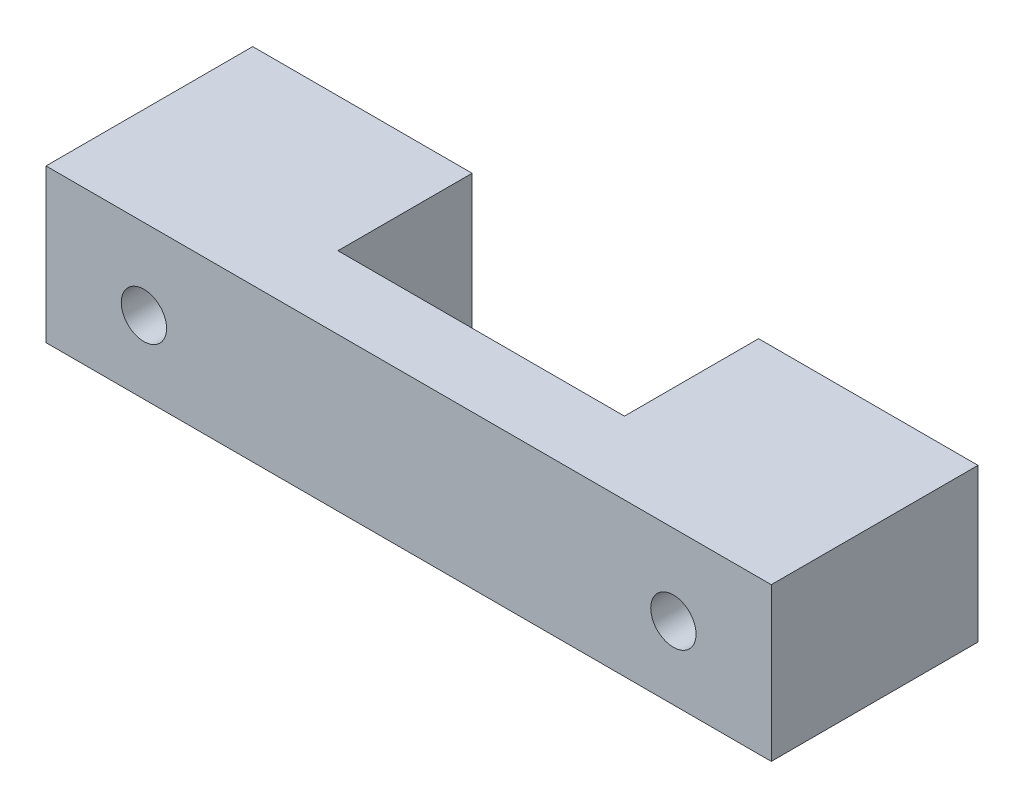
ISO-10303-21;
HEADER;
FILE_DESCRIPTION(('STEP AP214'),'2;1');
FILE_NAME('part.step','',(''),(''),'','','');
FILE_SCHEMA(('AUTOMOTIVE_DESIGN { 1 0 10303 214 1 1 1 1 }'));
ENDSEC;
DATA;
#1=APPLICATION_CONTEXT('core data for automotive mechanical design processes');
#2=APPLICATION_PROTOCOL_DEFINITION('international standard','automotive_design',2000,#1);
#3=PRODUCT_CONTEXT('',#1,'mechanical');
#4=PRODUCT('Part','Part','',(#3));
#5=PRODUCT_RELATED_PRODUCT_CATEGORY('part','',(#4));
#6=PRODUCT_DEFINITION_FORMATION('','',#4);
#7=PRODUCT_DEFINITION_CONTEXT('part definition',#1,'design');
#8=PRODUCT_DEFINITION('design','',#6,#7);
#9=PRODUCT_DEFINITION_SHAPE('','',#8);
#10=(LENGTH_UNIT() NAMED_UNIT(*) SI_UNIT(.MILLI.,.METRE.));
#11=(NAMED_UNIT(*) PLANE_ANGLE_UNIT() SI_UNIT($,.RADIAN.));
#12=(NAMED_UNIT(*) SI_UNIT($,.STERADIAN.) SOLID_ANGLE_UNIT());
#13=UNCERTAINTY_MEASURE_WITH_UNIT(LENGTH_MEASURE(1.E-05),#10,'distance_accuracy_value','');
#14=(GEOMETRIC_REPRESENTATION_CONTEXT(3) GLOBAL_UNCERTAINTY_ASSIGNED_CONTEXT((#13)) GLOBAL_UNIT_ASSIGNED_CONTEXT((#10,
#11,#12)) REPRESENTATION_CONTEXT('',''));
#15=CARTESIAN_POINT('',(0.,0.,0.));
#16=DIRECTION('',(0.,0.,1.));
#17=DIRECTION('',(1.,0.,0.));
#18=AXIS2_PLACEMENT_3D('',#15,#16,#17);
#19=CARTESIAN_POINT('',(-25.4,25.072417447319,9.398));
#20=DIRECTION('',(0.,0.,-1.));
#21=DIRECTION('',(-1.,0.,0.));
#22=AXIS2_PLACEMENT_3D('',#19,#20,#21);
#23=PLANE('',#22);
#24=DIRECTION('',(-1.,0.,0.));
#25=VECTOR('',#24,1.);
#26=CARTESIAN_POINT('',(-25.4,25.072417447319,9.398));
#27=LINE('',#26,#25);
#28=CARTESIAN_POINT('',(10.033,25.072417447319,9.398));
#29=VERTEX_POINT('',#28);
#30=CARTESIAN_POINT('',(-10.033,25.072417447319,9.398));
#31=VERTEX_POINT('',#30);
#32=EDGE_CURVE('E35',#29,#31,#27,.T.);
#33=ORIENTED_EDGE('',*,*,#32,.F.);
#34=DIRECTION('',(0.,-1.,0.));
#35=VECTOR('',#34,1.);
#36=CARTESIAN_POINT('',(10.033,14.3509999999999,9.398));
#37=LINE('',#36,#35);
#38=CARTESIAN_POINT('',(10.033,14.3509999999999,9.398));
#39=VERTEX_POINT('',#38);
#40=EDGE_CURVE('E128',#29,#39,#37,.T.);
#41=ORIENTED_EDGE('',*,*,#40,.T.);
#42=DIRECTION('',(1.,0.,0.));
#43=VECTOR('',#42,1.);
#44=CARTESIAN_POINT('',(-25.4,14.3509999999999,9.398));
#45=LINE('',#44,#43);
#46=CARTESIAN_POINT('',(-10.033,14.3509999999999,9.398));
#47=VERTEX_POINT('',#46);
#48=EDGE_CURVE('E112',#47,#39,#45,.T.);
#49=ORIENTED_EDGE('',*,*,#48,.F.);
#50=DIRECTION('',(0.,1.,0.));
#51=VECTOR('',#50,1.);
#52=CARTESIAN_POINT('',(-10.033,14.3509999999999,9.398));
#53=LINE('',#52,#51);
#54=EDGE_CURVE('E99',#47,#31,#53,.T.);
#55=ORIENTED_EDGE('',*,*,#54,.T.);
#56=EDGE_LOOP('',(#33,#41,#49,#55));
#57=FACE_BOUND('',#56,.T.);
#58=ADVANCED_FACE('F31',(#57),#23,.T.);
#59=CARTESIAN_POINT('',(-10.033,14.3509999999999,9.398));
#60=DIRECTION('',(-1.,0.,0.));
#61=DIRECTION('',(0.,0.,1.));
#62=AXIS2_PLACEMENT_3D('',#59,#60,#61);
#63=PLANE('',#62);
#64=DIRECTION('',(0.,1.,0.));
#65=VECTOR('',#64,1.);
#66=CARTESIAN_POINT('',(-10.033,14.3509999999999,0.));
#67=LINE('',#66,#65);
#68=CARTESIAN_POINT('',(-10.033,14.3509999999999,0.));
#69=VERTEX_POINT('',#68);
#70=CARTESIAN_POINT('',(-10.033,25.072417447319,0.));
#71=VERTEX_POINT('',#70);
#72=EDGE_CURVE('E98',#69,#71,#67,.T.);
#73=ORIENTED_EDGE('',*,*,#72,.T.);
#74=DIRECTION('',(0.,0.,-1.));
#75=VECTOR('',#74,1.);
#76=CARTESIAN_POINT('',(-10.033,25.072417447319,9.398));
#77=LINE('',#76,#75);
#78=EDGE_CURVE('E11',#31,#71,#77,.T.);
#79=ORIENTED_EDGE('',*,*,#78,.F.);
#80=ORIENTED_EDGE('',*,*,#54,.F.);
#81=DIRECTION('',(0.,0.,-1.));
#82=VECTOR('',#81,1.);
#83=CARTESIAN_POINT('',(-10.033,14.3509999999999,9.398));
#84=LINE('',#83,#82);
#85=EDGE_CURVE('E58',#47,#69,#84,.T.);
#86=ORIENTED_EDGE('',*,*,#85,.T.);
#87=EDGE_LOOP('',(#73,#79,#80,#86));
#88=FACE_BOUND('',#87,.T.);
#89=ADVANCED_FACE('F33',(#88),#63,.F.);
#90=CARTESIAN_POINT('',(-10.033,25.072417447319,9.398));
#91=DIRECTION('',(0.,-1.,0.));
#92=DIRECTION('',(1.,0.,0.));
#93=AXIS2_PLACEMENT_3D('',#90,#91,#92);
#94=PLANE('',#93);
#95=DIRECTION('',(-1.,0.,0.));
#96=VECTOR('',#95,1.);
#97=CARTESIAN_POINT('',(-10.033,25.072417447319,0.));
#98=LINE('',#97,#96);
#99=CARTESIAN_POINT('',(-25.4,25.072417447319,0.));
#100=VERTEX_POINT('',#99);
#101=EDGE_CURVE('E87',#71,#100,#98,.T.);
#102=ORIENTED_EDGE('',*,*,#101,.T.);
#103=DIRECTION('',(0.,0.,-1.));
#104=VECTOR('',#103,1.);
#105=CARTESIAN_POINT('',(-25.4,25.072417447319,9.398));
#106=LINE('',#105,#104);
#107=CARTESIAN_POINT('',(-25.4,25.072417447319,14.478));
#108=VERTEX_POINT('',#107);
#109=EDGE_CURVE('E41',#108,#100,#106,.T.);
#110=ORIENTED_EDGE('',*,*,#109,.F.);
#111=DIRECTION('',(-1.,0.,0.));
#112=VECTOR('',#111,1.);
#113=CARTESIAN_POINT('',(-25.4,25.072417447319,14.478));
#114=LINE('',#113,#112);
#115=CARTESIAN_POINT('',(25.4,25.072417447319,14.478));
#116=VERTEX_POINT('',#115);
#117=EDGE_CURVE('E143',#116,#108,#114,.T.);
#118=ORIENTED_EDGE('',*,*,#117,.F.);
#119=DIRECTION('',(0.,0.,-1.));
#120=VECTOR('',#119,1.);
#121=CARTESIAN_POINT('',(25.4,25.072417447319,14.478));
#122=LINE('',#121,#120);
#123=CARTESIAN_POINT('',(25.4,25.072417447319,0.));
#124=VERTEX_POINT('',#123);
#125=EDGE_CURVE('E144',#116,#124,#122,.T.);
#126=ORIENTED_EDGE('',*,*,#125,.T.);
#127=DIRECTION('',(-1.,0.,0.));
#128=VECTOR('',#127,1.);
#129=CARTESIAN_POINT('',(10.033,25.072417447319,0.));
#130=LINE('',#129,#128);
#131=CARTESIAN_POINT('',(10.033,25.072417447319,0.));
#132=VERTEX_POINT('',#131);
#133=EDGE_CURVE('E169',#124,#132,#130,.T.);
#134=ORIENTED_EDGE('',*,*,#133,.T.);
#135=DIRECTION('',(0.,0.,-1.));
#136=VECTOR('',#135,1.);
#137=CARTESIAN_POINT('',(10.033,25.072417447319,9.398));
#138=LINE('',#137,#136);
#139=EDGE_CURVE('E129',#29,#132,#138,.T.);
#140=ORIENTED_EDGE('',*,*,#139,.F.);
#141=ORIENTED_EDGE('',*,*,#32,.T.);
#142=ORIENTED_EDGE('',*,*,#78,.T.);
#143=EDGE_LOOP('',(#102,#110,#118,#126,#134,#140,#141,#142));
#144=FACE_BOUND('',#143,.T.);
#145=ADVANCED_FACE('F117',(#144),#94,.F.);
#146=CARTESIAN_POINT('',(-25.4,25.072417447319,9.398));
#147=DIRECTION('',(1.,0.,0.));
#148=DIRECTION('',(0.,0.,-1.));
#149=AXIS2_PLACEMENT_3D('',#146,#147,#148);
#150=PLANE('',#149);
#151=DIRECTION('',(0.,-1.,0.));
#152=VECTOR('',#151,1.);
#153=CARTESIAN_POINT('',(-25.4,25.072417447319,0.));
#154=LINE('',#153,#152);
#155=CARTESIAN_POINT('',(-25.4,14.3509999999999,0.));
#156=VERTEX_POINT('',#155);
#157=EDGE_CURVE('E76',#100,#156,#154,.T.);
#158=ORIENTED_EDGE('',*,*,#157,.T.);
#159=DIRECTION('',(0.,0.,-1.));
#160=VECTOR('',#159,1.);
#161=CARTESIAN_POINT('',(-25.4,14.3509999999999,9.398));
#162=LINE('',#161,#160);
#163=CARTESIAN_POINT('',(-25.4,14.3509999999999,14.478));
#164=VERTEX_POINT('',#163);
#165=EDGE_CURVE('E81',#164,#156,#162,.T.);
#166=ORIENTED_EDGE('',*,*,#165,.F.);
#167=DIRECTION('',(0.,-1.,0.));
#168=VECTOR('',#167,1.);
#169=CARTESIAN_POINT('',(-25.4,14.3509999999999,14.478));
#170=LINE('',#169,#168);
#171=EDGE_CURVE('E130',#108,#164,#170,.T.);
#172=ORIENTED_EDGE('',*,*,#171,.F.);
#173=ORIENTED_EDGE('',*,*,#109,.T.);
#174=EDGE_LOOP('',(#158,#166,#172,#173));
#175=FACE_BOUND('',#174,.T.);
#176=ADVANCED_FACE('F78',(#175),#150,.F.);
#177=CARTESIAN_POINT('',(-25.4,14.3509999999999,9.398));
#178=DIRECTION('',(0.,1.,0.));
#179=DIRECTION('',(-1.,0.,0.));
#180=AXIS2_PLACEMENT_3D('',#177,#178,#179);
#181=PLANE('',#180);
#182=DIRECTION('',(1.,0.,0.));
#183=VECTOR('',#182,1.);
#184=CARTESIAN_POINT('',(-25.4,14.3509999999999,0.));
#185=LINE('',#184,#183);
#186=EDGE_CURVE('E86',#156,#69,#185,.T.);
#187=ORIENTED_EDGE('',*,*,#186,.T.);
#188=ORIENTED_EDGE('',*,*,#85,.F.);
#189=ORIENTED_EDGE('',*,*,#48,.T.);
#190=DIRECTION('',(0.,0.,-1.));
#191=VECTOR('',#190,1.);
#192=CARTESIAN_POINT('',(10.033,14.3509999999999,9.398));
#193=LINE('',#192,#191);
#194=CARTESIAN_POINT('',(10.033,14.3509999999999,0.));
#195=VERTEX_POINT('',#194);
#196=EDGE_CURVE('E49',#39,#195,#193,.T.);
#197=ORIENTED_EDGE('',*,*,#196,.T.);
#198=DIRECTION('',(1.,0.,0.));
#199=VECTOR('',#198,1.);
#200=CARTESIAN_POINT('',(25.4,14.3509999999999,0.));
#201=LINE('',#200,#199);
#202=CARTESIAN_POINT('',(25.4,14.3509999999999,0.));
#203=VERTEX_POINT('',#202);
#204=EDGE_CURVE('E167',#195,#203,#201,.T.);
#205=ORIENTED_EDGE('',*,*,#204,.T.);
#206=DIRECTION('',(0.,0.,-1.));
#207=VECTOR('',#206,1.);
#208=CARTESIAN_POINT('',(25.4,14.3509999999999,14.478));
#209=LINE('',#208,#207);
#210=CARTESIAN_POINT('',(25.4,14.3509999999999,14.478));
#211=VERTEX_POINT('',#210);
#212=EDGE_CURVE('E115',#211,#203,#209,.T.);
#213=ORIENTED_EDGE('',*,*,#212,.F.);
#214=DIRECTION('',(1.,0.,0.));
#215=VECTOR('',#214,1.);
#216=CARTESIAN_POINT('',(-25.4,14.3509999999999,14.478));
#217=LINE('',#216,#215);
#218=EDGE_CURVE('E92',#164,#211,#217,.T.);
#219=ORIENTED_EDGE('',*,*,#218,.F.);
#220=ORIENTED_EDGE('',*,*,#165,.T.);
#221=EDGE_LOOP('',(#187,#188,#189,#197,#205,#213,#219,#220));
#222=FACE_BOUND('',#221,.T.);
#223=ADVANCED_FACE('F89',(#222),#181,.F.);
#224=CARTESIAN_POINT('',(-10.033,25.072417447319,0.));
#225=DIRECTION('',(0.,0.,1.));
#226=DIRECTION('',(1.,0.,0.));
#227=AXIS2_PLACEMENT_3D('',#224,#225,#226);
#228=PLANE('',#227);
#229=CARTESIAN_POINT('',(-18.5431134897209,19.4335986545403,0.));
#230=DIRECTION('',(0.,0.,-1.));
#231=DIRECTION('',(-1.,0.,0.));
#232=AXIS2_PLACEMENT_3D('',#229,#230,#231);
#233=CIRCLE('',#232,1.5875);
#234=CARTESIAN_POINT('',(-20.1306134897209,19.4335986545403,0.));
#235=VERTEX_POINT('',#234);
#236=EDGE_CURVE('E282',#235,#235,#233,.T.);
#237=ORIENTED_EDGE('',*,*,#236,.F.);
#238=EDGE_LOOP('',(#237));
#239=FACE_BOUND('',#238,.T.);
#240=ORIENTED_EDGE('',*,*,#72,.F.);
#241=ORIENTED_EDGE('',*,*,#186,.F.);
#242=ORIENTED_EDGE('',*,*,#157,.F.);
#243=ORIENTED_EDGE('',*,*,#101,.F.);
#244=EDGE_LOOP('',(#240,#241,#242,#243));
#245=FACE_BOUND('',#244,.T.);
#246=ADVANCED_FACE('F96',(#239,#245),#228,.F.);
#247=CARTESIAN_POINT('',(25.4,14.3509999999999,14.478));
#248=DIRECTION('',(-1.,0.,0.));
#249=DIRECTION('',(0.,0.,1.));
#250=AXIS2_PLACEMENT_3D('',#247,#248,#249);
#251=PLANE('',#250);
#252=ORIENTED_EDGE('',*,*,#212,.T.);
#253=DIRECTION('',(0.,1.,0.));
#254=VECTOR('',#253,1.);
#255=CARTESIAN_POINT('',(25.4,25.072417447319,0.));
#256=LINE('',#255,#254);
#257=EDGE_CURVE('E158',#203,#124,#256,.T.);
#258=ORIENTED_EDGE('',*,*,#257,.T.);
#259=ORIENTED_EDGE('',*,*,#125,.F.);
#260=DIRECTION('',(0.,1.,0.));
#261=VECTOR('',#260,1.);
#262=CARTESIAN_POINT('',(25.4,14.3509999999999,14.478));
#263=LINE('',#262,#261);
#264=EDGE_CURVE('E140',#211,#116,#263,.T.);
#265=ORIENTED_EDGE('',*,*,#264,.F.);
#266=EDGE_LOOP('',(#252,#258,#259,#265));
#267=FACE_BOUND('',#266,.T.);
#268=ADVANCED_FACE('F155',(#267),#251,.F.);
#269=CARTESIAN_POINT('',(-25.4,25.072417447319,14.478));
#270=DIRECTION('',(0.,0.,-1.));
#271=DIRECTION('',(-1.,0.,0.));
#272=AXIS2_PLACEMENT_3D('',#269,#270,#271);
#273=PLANE('',#272);
#274=CARTESIAN_POINT('',(-18.5431134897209,19.4335986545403,14.478));
#275=DIRECTION('',(0.,0.,-1.));
#276=DIRECTION('',(-1.,0.,0.));
#277=AXIS2_PLACEMENT_3D('',#274,#275,#276);
#278=CIRCLE('',#277,1.5875);
#279=CARTESIAN_POINT('',(-20.1306134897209,19.4335986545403,14.478));
#280=VERTEX_POINT('',#279);
#281=EDGE_CURVE('E279',#280,#280,#278,.T.);
#282=ORIENTED_EDGE('',*,*,#281,.T.);
#283=EDGE_LOOP('',(#282));
#284=FACE_BOUND('',#283,.T.);
#285=CARTESIAN_POINT('',(18.5431134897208,19.4335986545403,14.478));
#286=DIRECTION('',(0.,0.,-1.));
#287=DIRECTION('',(-1.,0.,0.));
#288=AXIS2_PLACEMENT_3D('',#285,#286,#287);
#289=CIRCLE('',#288,1.5875);
#290=CARTESIAN_POINT('',(16.9556134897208,19.4335986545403,14.478));
#291=VERTEX_POINT('',#290);
#292=EDGE_CURVE('E171',#291,#291,#289,.T.);
#293=ORIENTED_EDGE('',*,*,#292,.T.);
#294=EDGE_LOOP('',(#293));
#295=FACE_BOUND('',#294,.T.);
#296=ORIENTED_EDGE('',*,*,#171,.T.);
#297=ORIENTED_EDGE('',*,*,#218,.T.);
#298=ORIENTED_EDGE('',*,*,#264,.T.);
#299=ORIENTED_EDGE('',*,*,#117,.T.);
#300=EDGE_LOOP('',(#296,#297,#298,#299));
#301=FACE_BOUND('',#300,.T.);
#302=ADVANCED_FACE('F190',(#284,#295,#301),#273,.F.);
#303=CARTESIAN_POINT('',(10.033,14.3509999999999,9.398));
#304=DIRECTION('',(1.,0.,0.));
#305=DIRECTION('',(0.,0.,-1.));
#306=AXIS2_PLACEMENT_3D('',#303,#304,#305);
#307=PLANE('',#306);
#308=DIRECTION('',(0.,-1.,0.));
#309=VECTOR('',#308,1.);
#310=CARTESIAN_POINT('',(10.033,14.3509999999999,0.));
#311=LINE('',#310,#309);
#312=EDGE_CURVE('E179',#132,#195,#311,.T.);
#313=ORIENTED_EDGE('',*,*,#312,.T.);
#314=ORIENTED_EDGE('',*,*,#196,.F.);
#315=ORIENTED_EDGE('',*,*,#40,.F.);
#316=ORIENTED_EDGE('',*,*,#139,.T.);
#317=EDGE_LOOP('',(#313,#314,#315,#316));
#318=FACE_BOUND('',#317,.T.);
#319=ADVANCED_FACE('F180',(#318),#307,.F.);
#320=CARTESIAN_POINT('',(10.033,14.3509999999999,0.));
#321=DIRECTION('',(0.,0.,-1.));
#322=DIRECTION('',(-1.,0.,0.));
#323=AXIS2_PLACEMENT_3D('',#320,#321,#322);
#324=PLANE('',#323);
#325=CARTESIAN_POINT('',(18.5431134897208,19.4335986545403,0.));
#326=DIRECTION('',(0.,0.,-1.));
#327=DIRECTION('',(-1.,0.,0.));
#328=AXIS2_PLACEMENT_3D('',#325,#326,#327);
#329=CIRCLE('',#328,1.5875);
#330=CARTESIAN_POINT('',(16.9556134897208,19.4335986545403,0.));
#331=VERTEX_POINT('',#330);
#332=EDGE_CURVE('E174',#331,#331,#329,.T.);
#333=ORIENTED_EDGE('',*,*,#332,.F.);
#334=EDGE_LOOP('',(#333));
#335=FACE_BOUND('',#334,.T.);
#336=ORIENTED_EDGE('',*,*,#204,.F.);
#337=ORIENTED_EDGE('',*,*,#312,.F.);
#338=ORIENTED_EDGE('',*,*,#133,.F.);
#339=ORIENTED_EDGE('',*,*,#257,.F.);
#340=EDGE_LOOP('',(#336,#337,#338,#339));
#341=FACE_BOUND('',#340,.T.);
#342=ADVANCED_FACE('F165',(#335,#341),#324,.T.);
#343=CARTESIAN_POINT('',(18.5431134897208,19.4335986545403,14.478));
#344=DIRECTION('',(0.,0.,-1.));
#345=DIRECTION('',(-1.,0.,0.));
#346=AXIS2_PLACEMENT_3D('',#343,#344,#345);
#347=CYLINDRICAL_SURFACE('',#346,1.5875);
#348=CARTESIAN_POINT('',(16.9556134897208,19.4335986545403,14.478));
#349=CARTESIAN_POINT('',(16.9556134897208,19.4335986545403,14.3271875));
#350=CARTESIAN_POINT('',(16.9556134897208,19.4335986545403,14.176375));
#351=CARTESIAN_POINT('',(16.9556134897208,19.4335986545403,13.87475));
#352=CARTESIAN_POINT('',(16.9556134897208,19.4335986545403,13.7239375));
#353=CARTESIAN_POINT('',(16.9556134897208,19.4335986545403,13.4223125));
#354=CARTESIAN_POINT('',(16.9556134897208,19.4335986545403,13.2715));
#355=CARTESIAN_POINT('',(16.9556134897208,19.4335986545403,12.969875));
#356=CARTESIAN_POINT('',(16.9556134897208,19.4335986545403,12.8190625));
#357=CARTESIAN_POINT('',(16.9556134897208,19.4335986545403,12.5174375));
#358=CARTESIAN_POINT('',(16.9556134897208,19.4335986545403,12.366625));
#359=CARTESIAN_POINT('',(16.9556134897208,19.4335986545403,12.065));
#360=CARTESIAN_POINT('',(16.9556134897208,19.4335986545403,11.9141875));
#361=CARTESIAN_POINT('',(16.9556134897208,19.4335986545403,11.6125625));
#362=CARTESIAN_POINT('',(16.9556134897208,19.4335986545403,11.46175));
#363=CARTESIAN_POINT('',(16.9556134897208,19.4335986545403,11.160125));
#364=CARTESIAN_POINT('',(16.9556134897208,19.4335986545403,11.0093125));
#365=CARTESIAN_POINT('',(16.9556134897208,19.4335986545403,10.7076875));
#366=CARTESIAN_POINT('',(16.9556134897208,19.4335986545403,10.556875));
#367=CARTESIAN_POINT('',(16.9556134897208,19.4335986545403,10.25525));
#368=CARTESIAN_POINT('',(16.9556134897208,19.4335986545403,10.1044375));
#369=CARTESIAN_POINT('',(16.9556134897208,19.4335986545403,9.8028125));
#370=CARTESIAN_POINT('',(16.9556134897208,19.4335986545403,9.652));
#371=CARTESIAN_POINT('',(16.9556134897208,19.4335986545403,9.350375));
#372=CARTESIAN_POINT('',(16.9556134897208,19.4335986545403,9.1995625));
#373=CARTESIAN_POINT('',(16.9556134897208,19.4335986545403,8.8979375));
#374=CARTESIAN_POINT('',(16.9556134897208,19.4335986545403,8.747125));
#375=CARTESIAN_POINT('',(16.9556134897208,19.4335986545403,8.4455));
#376=CARTESIAN_POINT('',(16.9556134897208,19.4335986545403,8.2946875));
#377=CARTESIAN_POINT('',(16.9556134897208,19.4335986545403,7.9930625));
#378=CARTESIAN_POINT('',(16.9556134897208,19.4335986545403,7.84225));
#379=CARTESIAN_POINT('',(16.9556134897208,19.4335986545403,7.540625));
#380=CARTESIAN_POINT('',(16.9556134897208,19.4335986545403,7.3898125));
#381=CARTESIAN_POINT('',(16.9556134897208,19.4335986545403,7.0881875));
#382=CARTESIAN_POINT('',(16.9556134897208,19.4335986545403,6.937375));
#383=CARTESIAN_POINT('',(16.9556134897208,19.4335986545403,6.63575));
#384=CARTESIAN_POINT('',(16.9556134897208,19.4335986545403,6.4849375));
#385=CARTESIAN_POINT('',(16.9556134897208,19.4335986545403,6.1833125));
#386=CARTESIAN_POINT('',(16.9556134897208,19.4335986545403,6.0325));
#387=CARTESIAN_POINT('',(16.9556134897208,19.4335986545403,5.730875));
#388=CARTESIAN_POINT('',(16.9556134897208,19.4335986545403,5.5800625));
#389=CARTESIAN_POINT('',(16.9556134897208,19.4335986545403,5.2784375));
#390=CARTESIAN_POINT('',(16.9556134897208,19.4335986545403,5.127625));
#391=CARTESIAN_POINT('',(16.9556134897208,19.4335986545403,4.826));
#392=CARTESIAN_POINT('',(16.9556134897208,19.4335986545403,4.6751875));
#393=CARTESIAN_POINT('',(16.9556134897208,19.4335986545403,4.3735625));
#394=CARTESIAN_POINT('',(16.9556134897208,19.4335986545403,4.22275));
#395=CARTESIAN_POINT('',(16.9556134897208,19.4335986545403,3.921125));
#396=CARTESIAN_POINT('',(16.9556134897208,19.4335986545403,3.7703125));
#397=CARTESIAN_POINT('',(16.9556134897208,19.4335986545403,3.4686875));
#398=CARTESIAN_POINT('',(16.9556134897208,19.4335986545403,3.317875));
#399=CARTESIAN_POINT('',(16.9556134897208,19.4335986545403,3.01625));
#400=CARTESIAN_POINT('',(16.9556134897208,19.4335986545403,2.8654375));
#401=CARTESIAN_POINT('',(16.9556134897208,19.4335986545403,2.5638125));
#402=CARTESIAN_POINT('',(16.9556134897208,19.4335986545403,2.413));
#403=CARTESIAN_POINT('',(16.9556134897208,19.4335986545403,2.111375));
#404=CARTESIAN_POINT('',(16.9556134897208,19.4335986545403,1.9605625));
#405=CARTESIAN_POINT('',(16.9556134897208,19.4335986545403,1.6589375));
#406=CARTESIAN_POINT('',(16.9556134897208,19.4335986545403,1.508125));
#407=CARTESIAN_POINT('',(16.9556134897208,19.4335986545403,1.2065));
#408=CARTESIAN_POINT('',(16.9556134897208,19.4335986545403,1.0556875));
#409=CARTESIAN_POINT('',(16.9556134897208,19.4335986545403,0.754062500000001));
#410=CARTESIAN_POINT('',(16.9556134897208,19.4335986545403,0.603250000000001));
#411=CARTESIAN_POINT('',(16.9556134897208,19.4335986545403,0.301625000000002));
#412=CARTESIAN_POINT('',(16.9556134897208,19.4335986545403,0.150812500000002));
#413=CARTESIAN_POINT('',(16.9556134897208,19.4335986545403,0.));
#414=B_SPLINE_CURVE_WITH_KNOTS('',3,(#348,#349,#350,#351,#352,#353,#354,#355,#356,#357,#358,
#359,#360,#361,#362,#363,#364,#365,#366,#367,#368,#369,#370,#371,#372,#373,#374,#375,#376,#377,
#378,#379,#380,#381,#382,#383,#384,#385,#386,#387,#388,#389,#390,#391,#392,#393,#394,#395,#396,
#397,#398,#399,#400,#401,#402,#403,#404,#405,#406,#407,#408,#409,#410,#411,#412,#413),
.UNSPECIFIED.,.F.,.F.,(4,2,2,2,2,2,2,2,2,2,2,2,2,2,2,2,2,2,2,2,2,2,2,2,2,2,2,2,2,2,2,2,4),(0.,
0.452437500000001,0.904875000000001,1.3573125,1.80975,2.2621875,2.714625,3.1670625,3.6195,
4.0719375,4.524375,4.9768125,5.42925,5.8816875,6.334125,6.7865625,7.239,7.6914375,8.143875,
8.5963125,9.04875,9.5011875,9.953625,10.4060625,10.8585,11.3109375,11.763375,12.2158125,
12.66825,13.1206875,13.573125,14.0255625,14.478),.UNSPECIFIED.);
#415=EDGE_CURVE('BSEAM252',#291,#331,#414,.T.);
#416=ORIENTED_EDGE('',*,*,#292,.F.);
#417=ORIENTED_EDGE('',*,*,#332,.T.);
#418=ORIENTED_EDGE('',*,*,#415,.T.);
#419=ORIENTED_EDGE('',*,*,#415,.F.);
#420=EDGE_LOOP('',(#416,#418,#417,#419));
#421=FACE_BOUND('',#420,.T.);
#422=ADVANCED_FACE('F252',(#421),#347,.F.);
#423=CARTESIAN_POINT('',(-18.5431134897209,19.4335986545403,14.478));
#424=DIRECTION('',(0.,0.,-1.));
#425=DIRECTION('',(-1.,0.,0.));
#426=AXIS2_PLACEMENT_3D('',#423,#424,#425);
#427=CYLINDRICAL_SURFACE('',#426,1.5875);
#428=CARTESIAN_POINT('',(-20.1306134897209,19.4335986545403,14.478));
#429=CARTESIAN_POINT('',(-20.1306134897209,19.4335986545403,14.3271875));
#430=CARTESIAN_POINT('',(-20.1306134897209,19.4335986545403,14.176375));
#431=CARTESIAN_POINT('',(-20.1306134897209,19.4335986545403,13.87475));
#432=CARTESIAN_POINT('',(-20.1306134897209,19.4335986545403,13.7239375));
#433=CARTESIAN_POINT('',(-20.1306134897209,19.4335986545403,13.4223125));
#434=CARTESIAN_POINT('',(-20.1306134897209,19.4335986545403,13.2715));
#435=CARTESIAN_POINT('',(-20.1306134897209,19.4335986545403,12.969875));
#436=CARTESIAN_POINT('',(-20.1306134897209,19.4335986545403,12.8190625));
#437=CARTESIAN_POINT('',(-20.1306134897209,19.4335986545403,12.5174375));
#438=CARTESIAN_POINT('',(-20.1306134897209,19.4335986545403,12.366625));
#439=CARTESIAN_POINT('',(-20.1306134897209,19.4335986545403,12.065));
#440=CARTESIAN_POINT('',(-20.1306134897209,19.4335986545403,11.9141875));
#441=CARTESIAN_POINT('',(-20.1306134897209,19.4335986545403,11.6125625));
#442=CARTESIAN_POINT('',(-20.1306134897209,19.4335986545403,11.46175));
#443=CARTESIAN_POINT('',(-20.1306134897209,19.4335986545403,11.160125));
#444=CARTESIAN_POINT('',(-20.1306134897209,19.4335986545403,11.0093125));
#445=CARTESIAN_POINT('',(-20.1306134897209,19.4335986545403,10.7076875));
#446=CARTESIAN_POINT('',(-20.1306134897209,19.4335986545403,10.556875));
#447=CARTESIAN_POINT('',(-20.1306134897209,19.4335986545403,10.25525));
#448=CARTESIAN_POINT('',(-20.1306134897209,19.4335986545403,10.1044375));
#449=CARTESIAN_POINT('',(-20.1306134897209,19.4335986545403,9.8028125));
#450=CARTESIAN_POINT('',(-20.1306134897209,19.4335986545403,9.652));
#451=CARTESIAN_POINT('',(-20.1306134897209,19.4335986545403,9.350375));
#452=CARTESIAN_POINT('',(-20.1306134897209,19.4335986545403,9.1995625));
#453=CARTESIAN_POINT('',(-20.1306134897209,19.4335986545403,8.8979375));
#454=CARTESIAN_POINT('',(-20.1306134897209,19.4335986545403,8.747125));
#455=CARTESIAN_POINT('',(-20.1306134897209,19.4335986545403,8.4455));
#456=CARTESIAN_POINT('',(-20.1306134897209,19.4335986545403,8.2946875));
#457=CARTESIAN_POINT('',(-20.1306134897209,19.4335986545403,7.9930625));
#458=CARTESIAN_POINT('',(-20.1306134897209,19.4335986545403,7.84225));
#459=CARTESIAN_POINT('',(-20.1306134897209,19.4335986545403,7.540625));
#460=CARTESIAN_POINT('',(-20.1306134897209,19.4335986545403,7.3898125));
#461=CARTESIAN_POINT('',(-20.1306134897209,19.4335986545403,7.0881875));
#462=CARTESIAN_POINT('',(-20.1306134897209,19.4335986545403,6.937375));
#463=CARTESIAN_POINT('',(-20.1306134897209,19.4335986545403,6.63575));
#464=CARTESIAN_POINT('',(-20.1306134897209,19.4335986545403,6.4849375));
#465=CARTESIAN_POINT('',(-20.1306134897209,19.4335986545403,6.1833125));
#466=CARTESIAN_POINT('',(-20.1306134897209,19.4335986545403,6.0325));
#467=CARTESIAN_POINT('',(-20.1306134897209,19.4335986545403,5.730875));
#468=CARTESIAN_POINT('',(-20.1306134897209,19.4335986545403,5.5800625));
#469=CARTESIAN_POINT('',(-20.1306134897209,19.4335986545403,5.2784375));
#470=CARTESIAN_POINT('',(-20.1306134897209,19.4335986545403,5.127625));
#471=CARTESIAN_POINT('',(-20.1306134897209,19.4335986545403,4.826));
#472=CARTESIAN_POINT('',(-20.1306134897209,19.4335986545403,4.6751875));
#473=CARTESIAN_POINT('',(-20.1306134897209,19.4335986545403,4.3735625));
#474=CARTESIAN_POINT('',(-20.1306134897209,19.4335986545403,4.22275));
#475=CARTESIAN_POINT('',(-20.1306134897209,19.4335986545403,3.921125));
#476=CARTESIAN_POINT('',(-20.1306134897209,19.4335986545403,3.7703125));
#477=CARTESIAN_POINT('',(-20.1306134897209,19.4335986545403,3.4686875));
#478=CARTESIAN_POINT('',(-20.1306134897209,19.4335986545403,3.317875));
#479=CARTESIAN_POINT('',(-20.1306134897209,19.4335986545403,3.01625));
#480=CARTESIAN_POINT('',(-20.1306134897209,19.4335986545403,2.8654375));
#481=CARTESIAN_POINT('',(-20.1306134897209,19.4335986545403,2.5638125));
#482=CARTESIAN_POINT('',(-20.1306134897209,19.4335986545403,2.413));
#483=CARTESIAN_POINT('',(-20.1306134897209,19.4335986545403,2.111375));
#484=CARTESIAN_POINT('',(-20.1306134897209,19.4335986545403,1.9605625));
#485=CARTESIAN_POINT('',(-20.1306134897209,19.4335986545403,1.6589375));
#486=CARTESIAN_POINT('',(-20.1306134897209,19.4335986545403,1.508125));
#487=CARTESIAN_POINT('',(-20.1306134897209,19.4335986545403,1.2065));
#488=CARTESIAN_POINT('',(-20.1306134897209,19.4335986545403,1.0556875));
#489=CARTESIAN_POINT('',(-20.1306134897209,19.4335986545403,0.754062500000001));
#490=CARTESIAN_POINT('',(-20.1306134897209,19.4335986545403,0.603250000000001));
#491=CARTESIAN_POINT('',(-20.1306134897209,19.4335986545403,0.301625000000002));
#492=CARTESIAN_POINT('',(-20.1306134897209,19.4335986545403,0.150812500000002));
#493=CARTESIAN_POINT('',(-20.1306134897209,19.4335986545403,0.));
#494=B_SPLINE_CURVE_WITH_KNOTS('',3,(#428,#429,#430,#431,#432,#433,#434,#435,#436,#437,#438,
#439,#440,#441,#442,#443,#444,#445,#446,#447,#448,#449,#450,#451,#452,#453,#454,#455,#456,#457,
#458,#459,#460,#461,#462,#463,#464,#465,#466,#467,#468,#469,#470,#471,#472,#473,#474,#475,#476,
#477,#478,#479,#480,#481,#482,#483,#484,#485,#486,#487,#488,#489,#490,#491,#492,#493),
.UNSPECIFIED.,.F.,.F.,(4,2,2,2,2,2,2,2,2,2,2,2,2,2,2,2,2,2,2,2,2,2,2,2,2,2,2,2,2,2,2,2,4),(0.,
0.452437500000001,0.904875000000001,1.3573125,1.80975,2.2621875,2.714625,3.1670625,3.6195,
4.0719375,4.524375,4.9768125,5.42925,5.8816875,6.334125,6.7865625,7.239,7.6914375,8.143875,
8.5963125,9.04875,9.5011875,9.953625,10.4060625,10.8585,11.3109375,11.763375,12.2158125,
12.66825,13.1206875,13.573125,14.0255625,14.478),.UNSPECIFIED.);
#495=EDGE_CURVE('BSEAM259',#280,#235,#494,.T.);
#496=ORIENTED_EDGE('',*,*,#281,.F.);
#497=ORIENTED_EDGE('',*,*,#236,.T.);
#498=ORIENTED_EDGE('',*,*,#495,.T.);
#499=ORIENTED_EDGE('',*,*,#495,.F.);
#500=EDGE_LOOP('',(#496,#498,#497,#499));
#501=FACE_BOUND('',#500,.T.);
#502=ADVANCED_FACE('F259',(#501),#427,.F.);
#503=CLOSED_SHELL('',(#58,#89,#145,#176,#223,#246,#268,#302,#319,#342,#422,#502));
#504=MANIFOLD_SOLID_BREP('B2',#503);
#505=ADVANCED_BREP_SHAPE_REPRESENTATION('',(#18,#504),#14);
#506=SHAPE_DEFINITION_REPRESENTATION(#9,#505);
ENDSEC;
END-ISO-10303-21;
